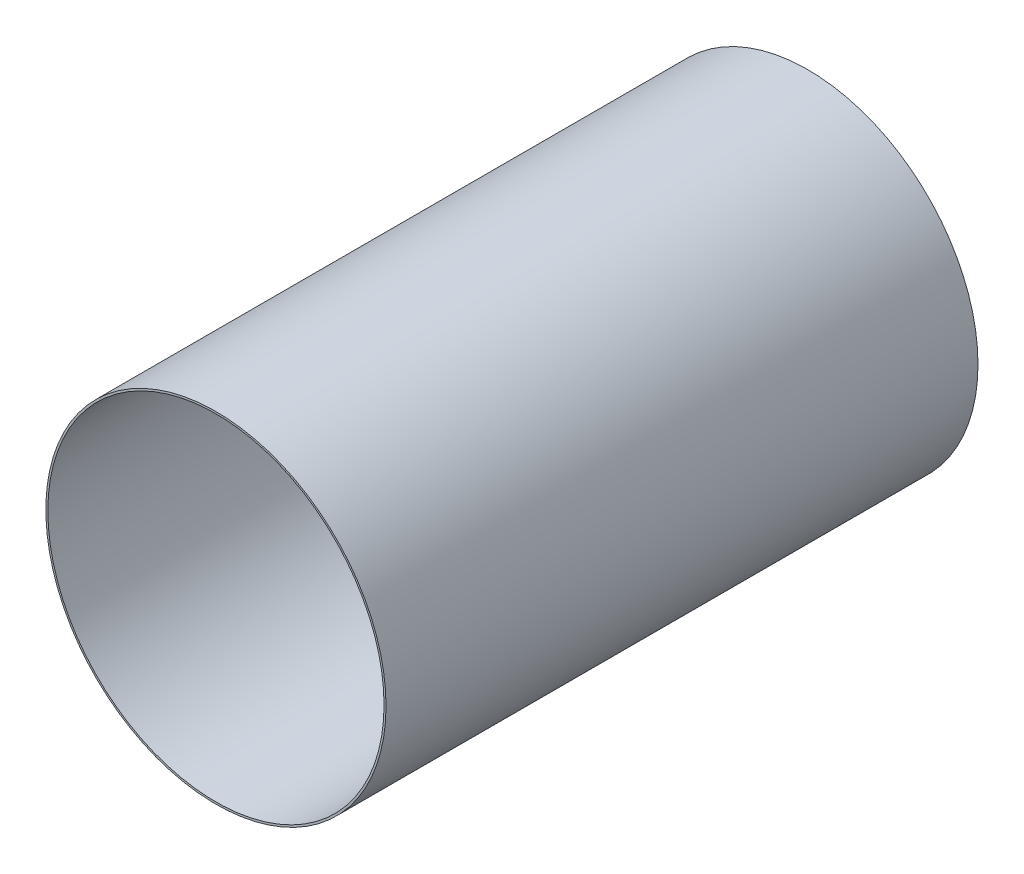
from build123d import *

# Parameters (mm, degrees)
SKETCH1_R           = 1723.9
SKETCH1_R_2         = 1703.9
BOSS_EXTRUDE1_DEPTH = 3000


with BuildPart() as part:
    # Sketch1 → Boss-Extrude1 (new, symmetric)
    with BuildSketch(Plane.XY):
        Circle(SKETCH1_R)
        Circle(SKETCH1_R_2, mode=Mode.SUBTRACT)
    extrude(amount=BOSS_EXTRUDE1_DEPTH, both=True)


solid = part.part
